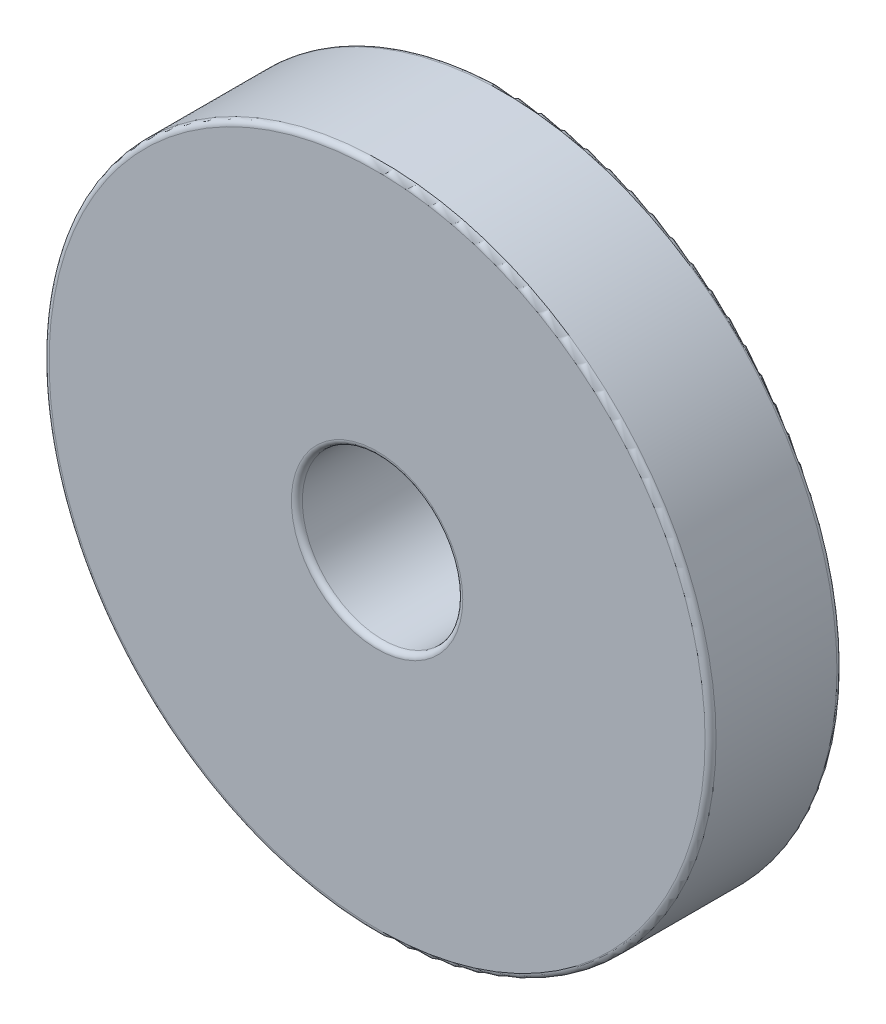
ISO-10303-21;
HEADER;
FILE_DESCRIPTION(('STEP AP214'),'2;1');
FILE_NAME('part.step','',(''),(''),'','','');
FILE_SCHEMA(('AUTOMOTIVE_DESIGN { 1 0 10303 214 1 1 1 1 }'));
ENDSEC;
DATA;
#1=APPLICATION_CONTEXT('core data for automotive mechanical design processes');
#2=APPLICATION_PROTOCOL_DEFINITION('international standard','automotive_design',2000,#1);
#3=PRODUCT_CONTEXT('',#1,'mechanical');
#4=PRODUCT('Part','Part','',(#3));
#5=PRODUCT_RELATED_PRODUCT_CATEGORY('part','',(#4));
#6=PRODUCT_DEFINITION_FORMATION('','',#4);
#7=PRODUCT_DEFINITION_CONTEXT('part definition',#1,'design');
#8=PRODUCT_DEFINITION('design','',#6,#7);
#9=PRODUCT_DEFINITION_SHAPE('','',#8);
#10=(LENGTH_UNIT() NAMED_UNIT(*) SI_UNIT(.MILLI.,.METRE.));
#11=(NAMED_UNIT(*) PLANE_ANGLE_UNIT() SI_UNIT($,.RADIAN.));
#12=(NAMED_UNIT(*) SI_UNIT($,.STERADIAN.) SOLID_ANGLE_UNIT());
#13=UNCERTAINTY_MEASURE_WITH_UNIT(LENGTH_MEASURE(1.E-05),#10,'distance_accuracy_value','');
#14=(GEOMETRIC_REPRESENTATION_CONTEXT(3) GLOBAL_UNCERTAINTY_ASSIGNED_CONTEXT((#13)) GLOBAL_UNIT_ASSIGNED_CONTEXT((#10,
#11,#12)) REPRESENTATION_CONTEXT('',''));
#15=CARTESIAN_POINT('',(0.,0.,0.));
#16=DIRECTION('',(0.,0.,1.));
#17=DIRECTION('',(1.,0.,0.));
#18=AXIS2_PLACEMENT_3D('',#15,#16,#17);
#19=CARTESIAN_POINT('',(0.,0.,-3.04799999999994));
#20=DIRECTION('',(0.,0.,1.));
#21=DIRECTION('',(1.,0.,0.));
#22=AXIS2_PLACEMENT_3D('',#19,#20,#21);
#23=CYLINDRICAL_SURFACE('',#22,7.7089);
#24=CARTESIAN_POINT('',(0.,0.,-2.92099999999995));
#25=DIRECTION('',(0.,0.,1.));
#26=DIRECTION('',(1.,0.,0.));
#27=AXIS2_PLACEMENT_3D('',#24,#25,#26);
#28=CIRCLE('',#27,7.7089);
#29=CARTESIAN_POINT('',(7.7089,0.,-2.92099999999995));
#30=VERTEX_POINT('',#29);
#31=EDGE_CURVE('E38',#30,#30,#28,.T.);
#32=CARTESIAN_POINT('',(0.,0.,-0.126999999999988));
#33=DIRECTION('',(0.,0.,1.));
#34=DIRECTION('',(1.,0.,0.));
#35=AXIS2_PLACEMENT_3D('',#32,#33,#34);
#36=CIRCLE('',#35,7.7089);
#37=CARTESIAN_POINT('',(7.7089,0.,-0.126999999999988));
#38=VERTEX_POINT('',#37);
#39=EDGE_CURVE('E42',#38,#38,#36,.F.);
#40=CARTESIAN_POINT('',(7.7089,0.,-2.92099999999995));
#41=CARTESIAN_POINT('',(7.7089,0.,-2.89189583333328));
#42=CARTESIAN_POINT('',(7.7089,0.,-2.86279166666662));
#43=CARTESIAN_POINT('',(7.7089,0.,-2.80458333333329));
#44=CARTESIAN_POINT('',(7.7089,0.,-2.77547916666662));
#45=CARTESIAN_POINT('',(7.7089,0.,-2.71727083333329));
#46=CARTESIAN_POINT('',(7.7089,0.,-2.68816666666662));
#47=CARTESIAN_POINT('',(7.7089,0.,-2.62995833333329));
#48=CARTESIAN_POINT('',(7.7089,0.,-2.60085416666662));
#49=CARTESIAN_POINT('',(7.7089,0.,-2.54264583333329));
#50=CARTESIAN_POINT('',(7.7089,0.,-2.51354166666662));
#51=CARTESIAN_POINT('',(7.7089,0.,-2.45533333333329));
#52=CARTESIAN_POINT('',(7.7089,0.,-2.42622916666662));
#53=CARTESIAN_POINT('',(7.7089,0.,-2.36802083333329));
#54=CARTESIAN_POINT('',(7.7089,0.,-2.33891666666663));
#55=CARTESIAN_POINT('',(7.7089,0.,-2.28070833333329));
#56=CARTESIAN_POINT('',(7.7089,0.,-2.25160416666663));
#57=CARTESIAN_POINT('',(7.7089,0.,-2.19339583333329));
#58=CARTESIAN_POINT('',(7.7089,0.,-2.16429166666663));
#59=CARTESIAN_POINT('',(7.7089,0.,-2.1060833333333));
#60=CARTESIAN_POINT('',(7.7089,0.,-2.07697916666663));
#61=CARTESIAN_POINT('',(7.7089,0.,-2.0187708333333));
#62=CARTESIAN_POINT('',(7.7089,0.,-1.98966666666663));
#63=CARTESIAN_POINT('',(7.7089,0.,-1.9314583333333));
#64=CARTESIAN_POINT('',(7.7089,0.,-1.90235416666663));
#65=CARTESIAN_POINT('',(7.7089,0.,-1.8441458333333));
#66=CARTESIAN_POINT('',(7.7089,0.,-1.81504166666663));
#67=CARTESIAN_POINT('',(7.7089,0.,-1.7568333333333));
#68=CARTESIAN_POINT('',(7.7089,0.,-1.72772916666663));
#69=CARTESIAN_POINT('',(7.7089,0.,-1.6695208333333));
#70=CARTESIAN_POINT('',(7.7089,0.,-1.64041666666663));
#71=CARTESIAN_POINT('',(7.7089,0.,-1.5822083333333));
#72=CARTESIAN_POINT('',(7.7089,0.,-1.55310416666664));
#73=CARTESIAN_POINT('',(7.7089,0.,-1.4948958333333));
#74=CARTESIAN_POINT('',(7.7089,0.,-1.46579166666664));
#75=CARTESIAN_POINT('',(7.7089,0.,-1.4075833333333));
#76=CARTESIAN_POINT('',(7.7089,0.,-1.37847916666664));
#77=CARTESIAN_POINT('',(7.7089,0.,-1.32027083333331));
#78=CARTESIAN_POINT('',(7.7089,0.,-1.29116666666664));
#79=CARTESIAN_POINT('',(7.7089,0.,-1.23295833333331));
#80=CARTESIAN_POINT('',(7.7089,0.,-1.20385416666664));
#81=CARTESIAN_POINT('',(7.7089,0.,-1.14564583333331));
#82=CARTESIAN_POINT('',(7.7089,0.,-1.11654166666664));
#83=CARTESIAN_POINT('',(7.7089,0.,-1.05833333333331));
#84=CARTESIAN_POINT('',(7.7089,0.,-1.02922916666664));
#85=CARTESIAN_POINT('',(7.7089,0.,-0.97102083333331));
#86=CARTESIAN_POINT('',(7.7089,0.,-0.941916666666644));
#87=CARTESIAN_POINT('',(7.7089,0.,-0.883708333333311));
#88=CARTESIAN_POINT('',(7.7089,0.,-0.854604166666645));
#89=CARTESIAN_POINT('',(7.7089,0.,-0.796395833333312));
#90=CARTESIAN_POINT('',(7.7089,0.,-0.767291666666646));
#91=CARTESIAN_POINT('',(7.7089,0.,-0.709083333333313));
#92=CARTESIAN_POINT('',(7.7089,0.,-0.679979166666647));
#93=CARTESIAN_POINT('',(7.7089,0.,-0.621770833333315));
#94=CARTESIAN_POINT('',(7.7089,0.,-0.592666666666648));
#95=CARTESIAN_POINT('',(7.7089,0.,-0.534458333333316));
#96=CARTESIAN_POINT('',(7.7089,0.,-0.50535416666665));
#97=CARTESIAN_POINT('',(7.7089,0.,-0.447145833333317));
#98=CARTESIAN_POINT('',(7.7089,0.,-0.418041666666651));
#99=CARTESIAN_POINT('',(7.7089,0.,-0.359833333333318));
#100=CARTESIAN_POINT('',(7.7089,0.,-0.330729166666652));
#101=CARTESIAN_POINT('',(7.7089,0.,-0.272520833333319));
#102=CARTESIAN_POINT('',(7.7089,0.,-0.243416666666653));
#103=CARTESIAN_POINT('',(7.7089,0.,-0.18520833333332));
#104=CARTESIAN_POINT('',(7.7089,0.,-0.156104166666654));
#105=CARTESIAN_POINT('',(7.7089,0.,-0.126999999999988));
#106=B_SPLINE_CURVE_WITH_KNOTS('',3,(#40,#41,#42,#43,#44,#45,#46,#47,#48,#49,#50,#51,#52,#53,
#54,#55,#56,#57,#58,#59,#60,#61,#62,#63,#64,#65,#66,#67,#68,#69,#70,#71,#72,#73,#74,#75,#76,#77,
#78,#79,#80,#81,#82,#83,#84,#85,#86,#87,#88,#89,#90,#91,#92,#93,#94,#95,#96,#97,#98,#99,#100,
#101,#102,#103,#104,#105),.UNSPECIFIED.,.F.,.F.,(4,2,2,2,2,2,2,2,2,2,2,2,2,2,2,2,2,2,2,2,2,2,2,
2,2,2,2,2,2,2,2,2,4),(0.,0.0873124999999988,0.174624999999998,0.261937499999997,
0.349249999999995,0.436562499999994,0.523874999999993,0.611187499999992,0.698499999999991,
0.78581249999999,0.873124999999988,0.960437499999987,1.04774999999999,1.13506249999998,
1.22237499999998,1.30968749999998,1.39699999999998,1.48431249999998,1.57162499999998,
1.65893749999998,1.74624999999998,1.83356249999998,1.92087499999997,2.00818749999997,
2.09549999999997,2.18281249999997,2.27012499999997,2.35743749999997,2.44474999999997,
2.53206249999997,2.61937499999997,2.70668749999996,2.79399999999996),.UNSPECIFIED.);
#107=EDGE_CURVE('BSEAM28',#30,#38,#106,.T.);
#108=ORIENTED_EDGE('',*,*,#31,.T.);
#109=ORIENTED_EDGE('',*,*,#39,.T.);
#110=ORIENTED_EDGE('',*,*,#107,.T.);
#111=ORIENTED_EDGE('',*,*,#107,.F.);
#112=EDGE_LOOP('',(#108,#110,#109,#111));
#113=FACE_BOUND('',#112,.T.);
#114=ADVANCED_FACE('F28',(#113),#23,.T.);
#115=CARTESIAN_POINT('',(0.,0.,-3.04799999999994));
#116=DIRECTION('',(0.,0.,1.));
#117=DIRECTION('',(1.,0.,0.));
#118=AXIS2_PLACEMENT_3D('',#115,#116,#117);
#119=PLANE('',#118);
#120=CARTESIAN_POINT('',(0.,0.,-3.04799999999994));
#121=DIRECTION('',(0.,0.,1.));
#122=DIRECTION('',(1.,0.,0.));
#123=AXIS2_PLACEMENT_3D('',#120,#121,#122);
#124=CIRCLE('',#123,1.9812);
#125=CARTESIAN_POINT('',(1.9812,0.,-3.04799999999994));
#126=VERTEX_POINT('',#125);
#127=EDGE_CURVE('E53',#126,#126,#124,.T.);
#128=ORIENTED_EDGE('',*,*,#127,.T.);
#129=EDGE_LOOP('',(#128));
#130=FACE_BOUND('',#129,.T.);
#131=CARTESIAN_POINT('',(0.,0.,-3.04799999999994));
#132=DIRECTION('',(0.,0.,1.));
#133=DIRECTION('',(1.,0.,0.));
#134=AXIS2_PLACEMENT_3D('',#131,#132,#133);
#135=CIRCLE('',#134,7.5819);
#136=CARTESIAN_POINT('',(7.5819,0.,-3.04799999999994));
#137=VERTEX_POINT('',#136);
#138=EDGE_CURVE('E56',#137,#137,#135,.F.);
#139=ORIENTED_EDGE('',*,*,#138,.T.);
#140=EDGE_LOOP('',(#139));
#141=FACE_BOUND('',#140,.T.);
#142=ADVANCED_FACE('F60',(#130,#141),#119,.F.);
#143=CARTESIAN_POINT('',(0.,0.,0.));
#144=DIRECTION('',(0.,0.,1.));
#145=DIRECTION('',(1.,0.,0.));
#146=AXIS2_PLACEMENT_3D('',#143,#144,#145);
#147=PLANE('',#146);
#148=CARTESIAN_POINT('',(0.,0.,0.));
#149=DIRECTION('',(0.,0.,1.));
#150=DIRECTION('',(1.,0.,0.));
#151=AXIS2_PLACEMENT_3D('',#148,#149,#150);
#152=CIRCLE('',#151,1.9812);
#153=CARTESIAN_POINT('',(1.9812,0.,0.));
#154=VERTEX_POINT('',#153);
#155=EDGE_CURVE('E10',#154,#154,#152,.F.);
#156=ORIENTED_EDGE('',*,*,#155,.T.);
#157=EDGE_LOOP('',(#156));
#158=FACE_BOUND('',#157,.T.);
#159=CARTESIAN_POINT('',(0.,0.,0.));
#160=DIRECTION('',(0.,0.,1.));
#161=DIRECTION('',(1.,0.,0.));
#162=AXIS2_PLACEMENT_3D('',#159,#160,#161);
#163=CIRCLE('',#162,7.5819);
#164=CARTESIAN_POINT('',(7.5819,0.,0.));
#165=VERTEX_POINT('',#164);
#166=EDGE_CURVE('E34',#165,#165,#163,.T.);
#167=ORIENTED_EDGE('',*,*,#166,.T.);
#168=EDGE_LOOP('',(#167));
#169=FACE_BOUND('',#168,.T.);
#170=ADVANCED_FACE('F90',(#158,#169),#147,.T.);
#171=CARTESIAN_POINT('',(0.,0.,-3.04799999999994));
#172=DIRECTION('',(0.,0.,1.));
#173=DIRECTION('',(1.,0.,0.));
#174=AXIS2_PLACEMENT_3D('',#171,#172,#173);
#175=CYLINDRICAL_SURFACE('',#174,1.8542);
#176=CARTESIAN_POINT('',(0.,0.,-2.92099999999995));
#177=DIRECTION('',(0.,0.,1.));
#178=DIRECTION('',(1.,0.,0.));
#179=AXIS2_PLACEMENT_3D('',#176,#177,#178);
#180=CIRCLE('',#179,1.8542);
#181=CARTESIAN_POINT('',(1.8542,0.,-2.92099999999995));
#182=VERTEX_POINT('',#181);
#183=EDGE_CURVE('E47',#182,#182,#180,.F.);
#184=CARTESIAN_POINT('',(0.,0.,-0.126999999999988));
#185=DIRECTION('',(0.,0.,1.));
#186=DIRECTION('',(1.,0.,0.));
#187=AXIS2_PLACEMENT_3D('',#184,#185,#186);
#188=CIRCLE('',#187,1.8542);
#189=CARTESIAN_POINT('',(1.8542,0.,-0.126999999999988));
#190=VERTEX_POINT('',#189);
#191=EDGE_CURVE('E50',#190,#190,#188,.T.);
#192=CARTESIAN_POINT('',(1.8542,0.,-2.92099999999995));
#193=CARTESIAN_POINT('',(1.8542,0.,-2.89189583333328));
#194=CARTESIAN_POINT('',(1.8542,0.,-2.86279166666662));
#195=CARTESIAN_POINT('',(1.8542,0.,-2.80458333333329));
#196=CARTESIAN_POINT('',(1.8542,0.,-2.77547916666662));
#197=CARTESIAN_POINT('',(1.8542,0.,-2.71727083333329));
#198=CARTESIAN_POINT('',(1.8542,0.,-2.68816666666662));
#199=CARTESIAN_POINT('',(1.8542,0.,-2.62995833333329));
#200=CARTESIAN_POINT('',(1.8542,0.,-2.60085416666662));
#201=CARTESIAN_POINT('',(1.8542,0.,-2.54264583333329));
#202=CARTESIAN_POINT('',(1.8542,0.,-2.51354166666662));
#203=CARTESIAN_POINT('',(1.8542,0.,-2.45533333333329));
#204=CARTESIAN_POINT('',(1.8542,0.,-2.42622916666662));
#205=CARTESIAN_POINT('',(1.8542,0.,-2.36802083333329));
#206=CARTESIAN_POINT('',(1.8542,0.,-2.33891666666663));
#207=CARTESIAN_POINT('',(1.8542,0.,-2.28070833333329));
#208=CARTESIAN_POINT('',(1.8542,0.,-2.25160416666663));
#209=CARTESIAN_POINT('',(1.8542,0.,-2.19339583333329));
#210=CARTESIAN_POINT('',(1.8542,0.,-2.16429166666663));
#211=CARTESIAN_POINT('',(1.8542,0.,-2.1060833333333));
#212=CARTESIAN_POINT('',(1.8542,0.,-2.07697916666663));
#213=CARTESIAN_POINT('',(1.8542,0.,-2.0187708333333));
#214=CARTESIAN_POINT('',(1.8542,0.,-1.98966666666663));
#215=CARTESIAN_POINT('',(1.8542,0.,-1.9314583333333));
#216=CARTESIAN_POINT('',(1.8542,0.,-1.90235416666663));
#217=CARTESIAN_POINT('',(1.8542,0.,-1.8441458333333));
#218=CARTESIAN_POINT('',(1.8542,0.,-1.81504166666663));
#219=CARTESIAN_POINT('',(1.8542,0.,-1.7568333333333));
#220=CARTESIAN_POINT('',(1.8542,0.,-1.72772916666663));
#221=CARTESIAN_POINT('',(1.8542,0.,-1.6695208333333));
#222=CARTESIAN_POINT('',(1.8542,0.,-1.64041666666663));
#223=CARTESIAN_POINT('',(1.8542,0.,-1.5822083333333));
#224=CARTESIAN_POINT('',(1.8542,0.,-1.55310416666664));
#225=CARTESIAN_POINT('',(1.8542,0.,-1.4948958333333));
#226=CARTESIAN_POINT('',(1.8542,0.,-1.46579166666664));
#227=CARTESIAN_POINT('',(1.8542,0.,-1.4075833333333));
#228=CARTESIAN_POINT('',(1.8542,0.,-1.37847916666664));
#229=CARTESIAN_POINT('',(1.8542,0.,-1.32027083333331));
#230=CARTESIAN_POINT('',(1.8542,0.,-1.29116666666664));
#231=CARTESIAN_POINT('',(1.8542,0.,-1.23295833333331));
#232=CARTESIAN_POINT('',(1.8542,0.,-1.20385416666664));
#233=CARTESIAN_POINT('',(1.8542,0.,-1.14564583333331));
#234=CARTESIAN_POINT('',(1.8542,0.,-1.11654166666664));
#235=CARTESIAN_POINT('',(1.8542,0.,-1.05833333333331));
#236=CARTESIAN_POINT('',(1.8542,0.,-1.02922916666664));
#237=CARTESIAN_POINT('',(1.8542,0.,-0.97102083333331));
#238=CARTESIAN_POINT('',(1.8542,0.,-0.941916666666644));
#239=CARTESIAN_POINT('',(1.8542,0.,-0.883708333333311));
#240=CARTESIAN_POINT('',(1.8542,0.,-0.854604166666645));
#241=CARTESIAN_POINT('',(1.8542,0.,-0.796395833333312));
#242=CARTESIAN_POINT('',(1.8542,0.,-0.767291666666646));
#243=CARTESIAN_POINT('',(1.8542,0.,-0.709083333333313));
#244=CARTESIAN_POINT('',(1.8542,0.,-0.679979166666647));
#245=CARTESIAN_POINT('',(1.8542,0.,-0.621770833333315));
#246=CARTESIAN_POINT('',(1.8542,0.,-0.592666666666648));
#247=CARTESIAN_POINT('',(1.8542,0.,-0.534458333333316));
#248=CARTESIAN_POINT('',(1.8542,0.,-0.50535416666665));
#249=CARTESIAN_POINT('',(1.8542,0.,-0.447145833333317));
#250=CARTESIAN_POINT('',(1.8542,0.,-0.418041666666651));
#251=CARTESIAN_POINT('',(1.8542,0.,-0.359833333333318));
#252=CARTESIAN_POINT('',(1.8542,0.,-0.330729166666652));
#253=CARTESIAN_POINT('',(1.8542,0.,-0.272520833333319));
#254=CARTESIAN_POINT('',(1.8542,0.,-0.243416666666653));
#255=CARTESIAN_POINT('',(1.8542,0.,-0.18520833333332));
#256=CARTESIAN_POINT('',(1.8542,0.,-0.156104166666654));
#257=CARTESIAN_POINT('',(1.8542,0.,-0.126999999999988));
#258=B_SPLINE_CURVE_WITH_KNOTS('',3,(#192,#193,#194,#195,#196,#197,#198,#199,#200,#201,#202,
#203,#204,#205,#206,#207,#208,#209,#210,#211,#212,#213,#214,#215,#216,#217,#218,#219,#220,#221,
#222,#223,#224,#225,#226,#227,#228,#229,#230,#231,#232,#233,#234,#235,#236,#237,#238,#239,#240,
#241,#242,#243,#244,#245,#246,#247,#248,#249,#250,#251,#252,#253,#254,#255,#256,#257),
.UNSPECIFIED.,.F.,.F.,(4,2,2,2,2,2,2,2,2,2,2,2,2,2,2,2,2,2,2,2,2,2,2,2,2,2,2,2,2,2,2,2,4),(0.,
0.0873124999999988,0.174624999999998,0.261937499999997,0.349249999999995,0.436562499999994,
0.523874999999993,0.611187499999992,0.698499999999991,0.78581249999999,0.873124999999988,
0.960437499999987,1.04774999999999,1.13506249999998,1.22237499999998,1.30968749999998,
1.39699999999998,1.48431249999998,1.57162499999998,1.65893749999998,1.74624999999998,
1.83356249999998,1.92087499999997,2.00818749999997,2.09549999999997,2.18281249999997,
2.27012499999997,2.35743749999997,2.44474999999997,2.53206249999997,2.61937499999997,
2.70668749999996,2.79399999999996),.UNSPECIFIED.);
#259=EDGE_CURVE('BSEAM86',#182,#190,#258,.T.);
#260=ORIENTED_EDGE('',*,*,#183,.T.);
#261=ORIENTED_EDGE('',*,*,#191,.T.);
#262=ORIENTED_EDGE('',*,*,#259,.T.);
#263=ORIENTED_EDGE('',*,*,#259,.F.);
#264=EDGE_LOOP('',(#260,#262,#261,#263));
#265=FACE_BOUND('',#264,.T.);
#266=ADVANCED_FACE('F86',(#265),#175,.F.);
#267=CARTESIAN_POINT('',(0.,0.,-2.92099999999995));
#268=DIRECTION('',(0.,0.,1.));
#269=DIRECTION('',(1.,0.,0.));
#270=AXIS2_PLACEMENT_3D('',#267,#268,#269);
#271=TOROIDAL_SURFACE('',#270,1.9812,0.127);
#272=ORIENTED_EDGE('',*,*,#183,.F.);
#273=EDGE_LOOP('',(#272));
#274=FACE_BOUND('',#273,.T.);
#275=ORIENTED_EDGE('',*,*,#127,.F.);
#276=EDGE_LOOP('',(#275));
#277=FACE_BOUND('',#276,.T.);
#278=ADVANCED_FACE('F66',(#274,#277),#271,.T.);
#279=CARTESIAN_POINT('',(0.,0.,-2.92099999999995));
#280=DIRECTION('',(0.,0.,1.));
#281=DIRECTION('',(1.,0.,0.));
#282=AXIS2_PLACEMENT_3D('',#279,#280,#281);
#283=TOROIDAL_SURFACE('',#282,7.5819,0.127);
#284=ORIENTED_EDGE('',*,*,#138,.F.);
#285=EDGE_LOOP('',(#284));
#286=FACE_BOUND('',#285,.T.);
#287=ORIENTED_EDGE('',*,*,#31,.F.);
#288=EDGE_LOOP('',(#287));
#289=FACE_BOUND('',#288,.T.);
#290=ADVANCED_FACE('F62',(#286,#289),#283,.T.);
#291=CARTESIAN_POINT('',(0.,0.,-0.126999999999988));
#292=DIRECTION('',(0.,0.,1.));
#293=DIRECTION('',(1.,0.,0.));
#294=AXIS2_PLACEMENT_3D('',#291,#292,#293);
#295=TOROIDAL_SURFACE('',#294,1.9812,0.127);
#296=ORIENTED_EDGE('',*,*,#155,.F.);
#297=EDGE_LOOP('',(#296));
#298=FACE_BOUND('',#297,.T.);
#299=ORIENTED_EDGE('',*,*,#191,.F.);
#300=EDGE_LOOP('',(#299));
#301=FACE_BOUND('',#300,.T.);
#302=ADVANCED_FACE('F65',(#298,#301),#295,.T.);
#303=CARTESIAN_POINT('',(0.,0.,-0.126999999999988));
#304=DIRECTION('',(0.,0.,1.));
#305=DIRECTION('',(1.,0.,0.));
#306=AXIS2_PLACEMENT_3D('',#303,#304,#305);
#307=TOROIDAL_SURFACE('',#306,7.5819,0.127);
#308=ORIENTED_EDGE('',*,*,#39,.F.);
#309=EDGE_LOOP('',(#308));
#310=FACE_BOUND('',#309,.T.);
#311=ORIENTED_EDGE('',*,*,#166,.F.);
#312=EDGE_LOOP('',(#311));
#313=FACE_BOUND('',#312,.T.);
#314=ADVANCED_FACE('F74',(#310,#313),#307,.T.);
#315=CLOSED_SHELL('',(#114,#142,#170,#266,#278,#290,#302,#314));
#316=MANIFOLD_SOLID_BREP('B2',#315);
#317=ADVANCED_BREP_SHAPE_REPRESENTATION('',(#18,#316),#14);
#318=SHAPE_DEFINITION_REPRESENTATION(#9,#317);
ENDSEC;
END-ISO-10303-21;
